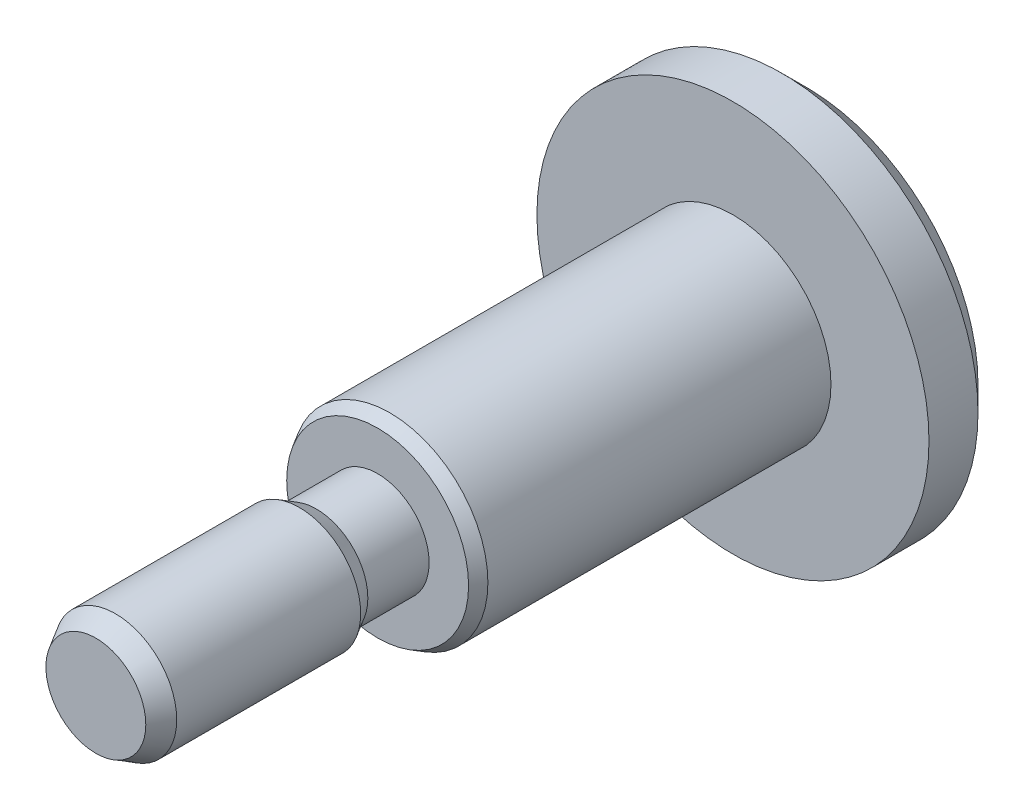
ISO-10303-21;
HEADER;
FILE_DESCRIPTION(('STEP AP214'),'2;1');
FILE_NAME('part.step','',(''),(''),'','','');
FILE_SCHEMA(('AUTOMOTIVE_DESIGN { 1 0 10303 214 1 1 1 1 }'));
ENDSEC;
DATA;
#1=APPLICATION_CONTEXT('core data for automotive mechanical design processes');
#2=APPLICATION_PROTOCOL_DEFINITION('international standard','automotive_design',2000,#1);
#3=PRODUCT_CONTEXT('',#1,'mechanical');
#4=PRODUCT('Part','Part','',(#3));
#5=PRODUCT_RELATED_PRODUCT_CATEGORY('part','',(#4));
#6=PRODUCT_DEFINITION_FORMATION('','',#4);
#7=PRODUCT_DEFINITION_CONTEXT('part definition',#1,'design');
#8=PRODUCT_DEFINITION('design','',#6,#7);
#9=PRODUCT_DEFINITION_SHAPE('','',#8);
#10=(LENGTH_UNIT() NAMED_UNIT(*) SI_UNIT(.MILLI.,.METRE.));
#11=(NAMED_UNIT(*) PLANE_ANGLE_UNIT() SI_UNIT($,.RADIAN.));
#12=(NAMED_UNIT(*) SI_UNIT($,.STERADIAN.) SOLID_ANGLE_UNIT());
#13=UNCERTAINTY_MEASURE_WITH_UNIT(LENGTH_MEASURE(1.E-05),#10,'distance_accuracy_value','');
#14=(GEOMETRIC_REPRESENTATION_CONTEXT(3) GLOBAL_UNCERTAINTY_ASSIGNED_CONTEXT((#13)) GLOBAL_UNIT_ASSIGNED_CONTEXT((#10,
#11,#12)) REPRESENTATION_CONTEXT('',''));
#15=CARTESIAN_POINT('',(0.,0.,0.));
#16=DIRECTION('',(0.,0.,1.));
#17=DIRECTION('',(1.,0.,0.));
#18=AXIS2_PLACEMENT_3D('',#15,#16,#17);
#19=CARTESIAN_POINT('',(0.,0.,17.5));
#20=DIRECTION('',(0.,0.,1.));
#21=DIRECTION('',(1.,0.,0.));
#22=AXIS2_PLACEMENT_3D('',#19,#20,#21);
#23=PLANE('',#22);
#24=CARTESIAN_POINT('',(0.,0.,17.5));
#25=DIRECTION('',(0.,0.,1.));
#26=DIRECTION('',(1.,0.,0.));
#27=AXIS2_PLACEMENT_3D('',#24,#25,#26);
#28=CIRCLE('',#27,3.71132486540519);
#29=CARTESIAN_POINT('',(3.71132486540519,0.,17.5));
#30=VERTEX_POINT('',#29);
#31=EDGE_CURVE('E79',#30,#30,#28,.T.);
#32=ORIENTED_EDGE('',*,*,#31,.T.);
#33=EDGE_LOOP('',(#32));
#34=FACE_BOUND('',#33,.T.);
#35=CARTESIAN_POINT('',(0.,0.,17.5));
#36=DIRECTION('',(0.,0.,1.));
#37=DIRECTION('',(1.,0.,0.));
#38=AXIS2_PLACEMENT_3D('',#35,#36,#37);
#39=CIRCLE('',#38,2.1);
#40=CARTESIAN_POINT('',(2.1,0.,17.5));
#41=VERTEX_POINT('',#40);
#42=EDGE_CURVE('E95',#41,#41,#39,.T.);
#43=ORIENTED_EDGE('',*,*,#42,.F.);
#44=EDGE_LOOP('',(#43));
#45=FACE_BOUND('',#44,.T.);
#46=ADVANCED_FACE('F45',(#34,#45),#23,.T.);
#47=CARTESIAN_POINT('',(0.,0.,3.));
#48=DIRECTION('',(0.,0.,1.));
#49=DIRECTION('',(1.,0.,0.));
#50=AXIS2_PLACEMENT_3D('',#47,#48,#49);
#51=PLANE('',#50);
#52=CARTESIAN_POINT('',(0.,0.,3.));
#53=DIRECTION('',(0.,0.,1.));
#54=DIRECTION('',(1.,0.,0.));
#55=AXIS2_PLACEMENT_3D('',#52,#53,#54);
#56=CIRCLE('',#55,8.);
#57=CARTESIAN_POINT('',(8.,0.,3.));
#58=VERTEX_POINT('',#57);
#59=EDGE_CURVE('E83',#58,#58,#56,.T.);
#60=ORIENTED_EDGE('',*,*,#59,.T.);
#61=EDGE_LOOP('',(#60));
#62=FACE_BOUND('',#61,.T.);
#63=CARTESIAN_POINT('',(0.,0.,3.));
#64=DIRECTION('',(0.,0.,1.));
#65=DIRECTION('',(1.,0.,0.));
#66=AXIS2_PLACEMENT_3D('',#63,#64,#65);
#67=CIRCLE('',#66,4.);
#68=CARTESIAN_POINT('',(-4.,0.,3.));
#69=VERTEX_POINT('',#68);
#70=EDGE_CURVE('E87',#69,#69,#67,.T.);
#71=ORIENTED_EDGE('',*,*,#70,.F.);
#72=EDGE_LOOP('',(#71));
#73=FACE_BOUND('',#72,.T.);
#74=ADVANCED_FACE('F104',(#62,#73),#51,.T.);
#75=CARTESIAN_POINT('',(0.,0.,3.));
#76=DIRECTION('',(0.,0.,-1.));
#77=DIRECTION('',(-1.,0.,0.));
#78=AXIS2_PLACEMENT_3D('',#75,#76,#77);
#79=CYLINDRICAL_SURFACE('',#78,8.);
#80=CARTESIAN_POINT('',(0.,0.,1.));
#81=DIRECTION('',(0.,0.,1.));
#82=DIRECTION('',(1.,0.,0.));
#83=AXIS2_PLACEMENT_3D('',#80,#81,#82);
#84=CIRCLE('',#83,8.);
#85=CARTESIAN_POINT('',(8.,0.,1.));
#86=VERTEX_POINT('',#85);
#87=EDGE_CURVE('E71',#86,#86,#84,.T.);
#88=ORIENTED_EDGE('',*,*,#87,.T.);
#89=EDGE_LOOP('',(#88));
#90=FACE_BOUND('',#89,.T.);
#91=ORIENTED_EDGE('',*,*,#59,.F.);
#92=EDGE_LOOP('',(#91));
#93=FACE_BOUND('',#92,.T.);
#94=ADVANCED_FACE('F47',(#90,#93),#79,.T.);
#95=CARTESIAN_POINT('',(0.,0.,0.));
#96=DIRECTION('',(0.,0.,1.));
#97=DIRECTION('',(1.,0.,0.));
#98=AXIS2_PLACEMENT_3D('',#95,#96,#97);
#99=PLANE('',#98);
#100=CARTESIAN_POINT('',(0.,0.,0.));
#101=DIRECTION('',(0.,0.,1.));
#102=DIRECTION('',(1.,0.,0.));
#103=AXIS2_PLACEMENT_3D('',#100,#101,#102);
#104=CIRCLE('',#103,7.);
#105=CARTESIAN_POINT('',(7.,0.,0.));
#106=VERTEX_POINT('',#105);
#107=EDGE_CURVE('E65',#106,#106,#104,.F.);
#108=ORIENTED_EDGE('',*,*,#107,.T.);
#109=EDGE_LOOP('',(#108));
#110=FACE_BOUND('',#109,.T.);
#111=ADVANCED_FACE('F120',(#110),#99,.F.);
#112=CARTESIAN_POINT('',(0.,0.,17.5));
#113=DIRECTION('',(0.,0.,-1.));
#114=DIRECTION('',(-1.,0.,0.));
#115=AXIS2_PLACEMENT_3D('',#112,#113,#114);
#116=CYLINDRICAL_SURFACE('',#115,4.);
#117=CARTESIAN_POINT('',(0.,0.,17.));
#118=DIRECTION('',(0.,0.,1.));
#119=DIRECTION('',(1.,0.,0.));
#120=AXIS2_PLACEMENT_3D('',#117,#118,#119);
#121=CIRCLE('',#120,4.);
#122=CARTESIAN_POINT('',(-4.,0.,17.));
#123=VERTEX_POINT('',#122);
#124=EDGE_CURVE('E75',#123,#123,#121,.F.);
#125=CARTESIAN_POINT('',(-4.,0.,17.));
#126=CARTESIAN_POINT('',(-4.,0.,16.8541666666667));
#127=CARTESIAN_POINT('',(-4.,0.,16.7083333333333));
#128=CARTESIAN_POINT('',(-4.,0.,16.4166666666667));
#129=CARTESIAN_POINT('',(-4.,0.,16.2708333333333));
#130=CARTESIAN_POINT('',(-4.,0.,15.9791666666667));
#131=CARTESIAN_POINT('',(-4.,0.,15.8333333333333));
#132=CARTESIAN_POINT('',(-4.,0.,15.5416666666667));
#133=CARTESIAN_POINT('',(-4.,0.,15.3958333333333));
#134=CARTESIAN_POINT('',(-4.,0.,15.1041666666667));
#135=CARTESIAN_POINT('',(-4.,0.,14.9583333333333));
#136=CARTESIAN_POINT('',(-4.,0.,14.6666666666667));
#137=CARTESIAN_POINT('',(-4.,0.,14.5208333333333));
#138=CARTESIAN_POINT('',(-4.,0.,14.2291666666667));
#139=CARTESIAN_POINT('',(-4.,0.,14.0833333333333));
#140=CARTESIAN_POINT('',(-4.,0.,13.7916666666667));
#141=CARTESIAN_POINT('',(-4.,0.,13.6458333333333));
#142=CARTESIAN_POINT('',(-4.,0.,13.3541666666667));
#143=CARTESIAN_POINT('',(-4.,0.,13.2083333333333));
#144=CARTESIAN_POINT('',(-4.,0.,12.9166666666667));
#145=CARTESIAN_POINT('',(-4.,0.,12.7708333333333));
#146=CARTESIAN_POINT('',(-4.,0.,12.4791666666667));
#147=CARTESIAN_POINT('',(-4.,0.,12.3333333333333));
#148=CARTESIAN_POINT('',(-4.,0.,12.0416666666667));
#149=CARTESIAN_POINT('',(-4.,0.,11.8958333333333));
#150=CARTESIAN_POINT('',(-4.,0.,11.6041666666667));
#151=CARTESIAN_POINT('',(-4.,0.,11.4583333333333));
#152=CARTESIAN_POINT('',(-4.,0.,11.1666666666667));
#153=CARTESIAN_POINT('',(-4.,0.,11.0208333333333));
#154=CARTESIAN_POINT('',(-4.,0.,10.7291666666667));
#155=CARTESIAN_POINT('',(-4.,0.,10.5833333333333));
#156=CARTESIAN_POINT('',(-4.,0.,10.2916666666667));
#157=CARTESIAN_POINT('',(-4.,0.,10.1458333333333));
#158=CARTESIAN_POINT('',(-4.,0.,9.85416666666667));
#159=CARTESIAN_POINT('',(-4.,0.,9.70833333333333));
#160=CARTESIAN_POINT('',(-4.,0.,9.41666666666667));
#161=CARTESIAN_POINT('',(-4.,0.,9.27083333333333));
#162=CARTESIAN_POINT('',(-4.,0.,8.97916666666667));
#163=CARTESIAN_POINT('',(-4.,0.,8.83333333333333));
#164=CARTESIAN_POINT('',(-4.,0.,8.54166666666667));
#165=CARTESIAN_POINT('',(-4.,0.,8.39583333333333));
#166=CARTESIAN_POINT('',(-4.,0.,8.10416666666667));
#167=CARTESIAN_POINT('',(-4.,0.,7.95833333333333));
#168=CARTESIAN_POINT('',(-4.,0.,7.66666666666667));
#169=CARTESIAN_POINT('',(-4.,0.,7.52083333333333));
#170=CARTESIAN_POINT('',(-4.,0.,7.22916666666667));
#171=CARTESIAN_POINT('',(-4.,0.,7.08333333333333));
#172=CARTESIAN_POINT('',(-4.,0.,6.79166666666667));
#173=CARTESIAN_POINT('',(-4.,0.,6.64583333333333));
#174=CARTESIAN_POINT('',(-4.,0.,6.35416666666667));
#175=CARTESIAN_POINT('',(-4.,0.,6.20833333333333));
#176=CARTESIAN_POINT('',(-4.,0.,5.91666666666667));
#177=CARTESIAN_POINT('',(-4.,0.,5.77083333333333));
#178=CARTESIAN_POINT('',(-4.,0.,5.47916666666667));
#179=CARTESIAN_POINT('',(-4.,0.,5.33333333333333));
#180=CARTESIAN_POINT('',(-4.,0.,5.04166666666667));
#181=CARTESIAN_POINT('',(-4.,0.,4.89583333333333));
#182=CARTESIAN_POINT('',(-4.,0.,4.60416666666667));
#183=CARTESIAN_POINT('',(-4.,0.,4.45833333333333));
#184=CARTESIAN_POINT('',(-4.,0.,4.16666666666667));
#185=CARTESIAN_POINT('',(-4.,0.,4.02083333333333));
#186=CARTESIAN_POINT('',(-4.,0.,3.72916666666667));
#187=CARTESIAN_POINT('',(-4.,0.,3.58333333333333));
#188=CARTESIAN_POINT('',(-4.,0.,3.29166666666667));
#189=CARTESIAN_POINT('',(-4.,0.,3.14583333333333));
#190=CARTESIAN_POINT('',(-4.,0.,3.));
#191=B_SPLINE_CURVE_WITH_KNOTS('',3,(#125,#126,#127,#128,#129,#130,#131,#132,#133,#134,#135,
#136,#137,#138,#139,#140,#141,#142,#143,#144,#145,#146,#147,#148,#149,#150,#151,#152,#153,#154,
#155,#156,#157,#158,#159,#160,#161,#162,#163,#164,#165,#166,#167,#168,#169,#170,#171,#172,#173,
#174,#175,#176,#177,#178,#179,#180,#181,#182,#183,#184,#185,#186,#187,#188,#189,#190),
.UNSPECIFIED.,.F.,.F.,(4,2,2,2,2,2,2,2,2,2,2,2,2,2,2,2,2,2,2,2,2,2,2,2,2,2,2,2,2,2,2,2,4),(0.,
0.437499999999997,0.874999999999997,1.3125,1.75,2.1875,2.625,3.0625,3.5,3.9375,4.375,4.8125,
5.25,5.6875,6.125,6.5625,7.,7.4375,7.875,8.3125,8.75,9.1875,9.625,10.0625,10.5,10.9375,11.375,
11.8125,12.25,12.6875,13.125,13.5625,14.),.UNSPECIFIED.);
#192=EDGE_CURVE('BSEAM117',#123,#69,#191,.T.);
#193=ORIENTED_EDGE('',*,*,#124,.T.);
#194=ORIENTED_EDGE('',*,*,#70,.T.);
#195=ORIENTED_EDGE('',*,*,#192,.T.);
#196=ORIENTED_EDGE('',*,*,#192,.F.);
#197=EDGE_LOOP('',(#193,#195,#194,#196));
#198=FACE_BOUND('',#197,.T.);
#199=ADVANCED_FACE('F117',(#198),#116,.T.);
#200=CARTESIAN_POINT('',(0.,0.,17.5));
#201=DIRECTION('',(0.,0.,-1.));
#202=DIRECTION('',(-1.,0.,0.));
#203=AXIS2_PLACEMENT_3D('',#200,#201,#202);
#204=CONICAL_SURFACE('',#203,3.71132486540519,0.523598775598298);
#205=ORIENTED_EDGE('',*,*,#124,.F.);
#206=EDGE_LOOP('',(#205));
#207=FACE_BOUND('',#206,.T.);
#208=ORIENTED_EDGE('',*,*,#31,.F.);
#209=EDGE_LOOP('',(#208));
#210=FACE_BOUND('',#209,.T.);
#211=ADVANCED_FACE('F115',(#207,#210),#204,.T.);
#212=CARTESIAN_POINT('',(0.,0.,1.));
#213=DIRECTION('',(0.,0.,1.));
#214=DIRECTION('',(1.,0.,0.));
#215=AXIS2_PLACEMENT_3D('',#212,#213,#214);
#216=CONICAL_SURFACE('',#215,8.,0.78539816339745);
#217=ORIENTED_EDGE('',*,*,#107,.F.);
#218=EDGE_LOOP('',(#217));
#219=FACE_BOUND('',#218,.T.);
#220=ORIENTED_EDGE('',*,*,#87,.F.);
#221=EDGE_LOOP('',(#220));
#222=FACE_BOUND('',#221,.T.);
#223=ADVANCED_FACE('F132',(#219,#222),#216,.T.);
#224=CARTESIAN_POINT('',(0.,0.,20.));
#225=DIRECTION('',(0.,0.,-1.));
#226=DIRECTION('',(-1.,0.,0.));
#227=AXIS2_PLACEMENT_3D('',#224,#225,#226);
#228=CYLINDRICAL_SURFACE('',#227,2.1);
#229=CARTESIAN_POINT('',(0.,0.,20.));
#230=DIRECTION('',(0.,0.,1.));
#231=DIRECTION('',(1.,0.,0.));
#232=AXIS2_PLACEMENT_3D('',#229,#230,#231);
#233=CIRCLE('',#232,2.1);
#234=CARTESIAN_POINT('',(2.1,0.,20.));
#235=VERTEX_POINT('',#234);
#236=EDGE_CURVE('E91',#235,#235,#233,.T.);
#237=ORIENTED_EDGE('',*,*,#236,.F.);
#238=EDGE_LOOP('',(#237));
#239=FACE_BOUND('',#238,.T.);
#240=ORIENTED_EDGE('',*,*,#42,.T.);
#241=EDGE_LOOP('',(#240));
#242=FACE_BOUND('',#241,.T.);
#243=ADVANCED_FACE('F101',(#239,#242),#228,.T.);
#244=CARTESIAN_POINT('',(0.,0.,29.));
#245=DIRECTION('',(0.,0.,-1.));
#246=DIRECTION('',(-1.,0.,0.));
#247=AXIS2_PLACEMENT_3D('',#244,#245,#246);
#248=CYLINDRICAL_SURFACE('',#247,2.5);
#249=CARTESIAN_POINT('',(0.,0.,20.6928203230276));
#250=DIRECTION('',(0.,0.,1.));
#251=DIRECTION('',(1.,0.,0.));
#252=AXIS2_PLACEMENT_3D('',#249,#250,#251);
#253=CIRCLE('',#252,2.5);
#254=CARTESIAN_POINT('',(2.5,0.,20.6928203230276));
#255=VERTEX_POINT('',#254);
#256=EDGE_CURVE('E10',#255,#255,#253,.T.);
#257=ORIENTED_EDGE('',*,*,#256,.T.);
#258=EDGE_LOOP('',(#257));
#259=FACE_BOUND('',#258,.T.);
#260=CARTESIAN_POINT('',(0.,0.,28.2));
#261=DIRECTION('',(0.,0.,1.));
#262=DIRECTION('',(1.,0.,0.));
#263=AXIS2_PLACEMENT_3D('',#260,#261,#262);
#264=CIRCLE('',#263,2.5);
#265=CARTESIAN_POINT('',(2.5,0.,28.2));
#266=VERTEX_POINT('',#265);
#267=EDGE_CURVE('E53',#266,#266,#264,.F.);
#268=ORIENTED_EDGE('',*,*,#267,.T.);
#269=EDGE_LOOP('',(#268));
#270=FACE_BOUND('',#269,.T.);
#271=ADVANCED_FACE('F143',(#259,#270),#248,.T.);
#272=CARTESIAN_POINT('',(0.,0.,29.));
#273=DIRECTION('',(0.,0.,1.));
#274=DIRECTION('',(1.,0.,0.));
#275=AXIS2_PLACEMENT_3D('',#272,#273,#274);
#276=PLANE('',#275);
#277=CARTESIAN_POINT('',(0.,0.,29.));
#278=DIRECTION('',(0.,0.,1.));
#279=DIRECTION('',(1.,0.,0.));
#280=AXIS2_PLACEMENT_3D('',#277,#278,#279);
#281=CIRCLE('',#280,2.0381197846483);
#282=CARTESIAN_POINT('',(2.0381197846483,0.,29.));
#283=VERTEX_POINT('',#282);
#284=EDGE_CURVE('E59',#283,#283,#281,.T.);
#285=ORIENTED_EDGE('',*,*,#284,.T.);
#286=EDGE_LOOP('',(#285));
#287=FACE_BOUND('',#286,.T.);
#288=ADVANCED_FACE('F149',(#287),#276,.T.);
#289=CARTESIAN_POINT('',(0.,0.,29.));
#290=DIRECTION('',(0.,0.,-1.));
#291=DIRECTION('',(-1.,0.,0.));
#292=AXIS2_PLACEMENT_3D('',#289,#290,#291);
#293=CONICAL_SURFACE('',#292,2.0381197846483,0.523598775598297);
#294=ORIENTED_EDGE('',*,*,#267,.F.);
#295=EDGE_LOOP('',(#294));
#296=FACE_BOUND('',#295,.T.);
#297=ORIENTED_EDGE('',*,*,#284,.F.);
#298=EDGE_LOOP('',(#297));
#299=FACE_BOUND('',#298,.T.);
#300=ADVANCED_FACE('F152',(#296,#299),#293,.T.);
#301=CARTESIAN_POINT('',(0.,0.,20.6928203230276));
#302=DIRECTION('',(0.,0.,1.));
#303=DIRECTION('',(1.,0.,0.));
#304=AXIS2_PLACEMENT_3D('',#301,#302,#303);
#305=CONICAL_SURFACE('',#304,2.5,0.523598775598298);
#306=ORIENTED_EDGE('',*,*,#236,.T.);
#307=EDGE_LOOP('',(#306));
#308=FACE_BOUND('',#307,.T.);
#309=ORIENTED_EDGE('',*,*,#256,.F.);
#310=EDGE_LOOP('',(#309));
#311=FACE_BOUND('',#310,.T.);
#312=ADVANCED_FACE('F156',(#308,#311),#305,.T.);
#313=CLOSED_SHELL('',(#46,#74,#94,#111,#199,#211,#223,#243,#271,#288,#300,#312));
#314=MANIFOLD_SOLID_BREP('B2',#313);
#315=ADVANCED_BREP_SHAPE_REPRESENTATION('',(#18,#314),#14);
#316=SHAPE_DEFINITION_REPRESENTATION(#9,#315);
ENDSEC;
END-ISO-10303-21;
